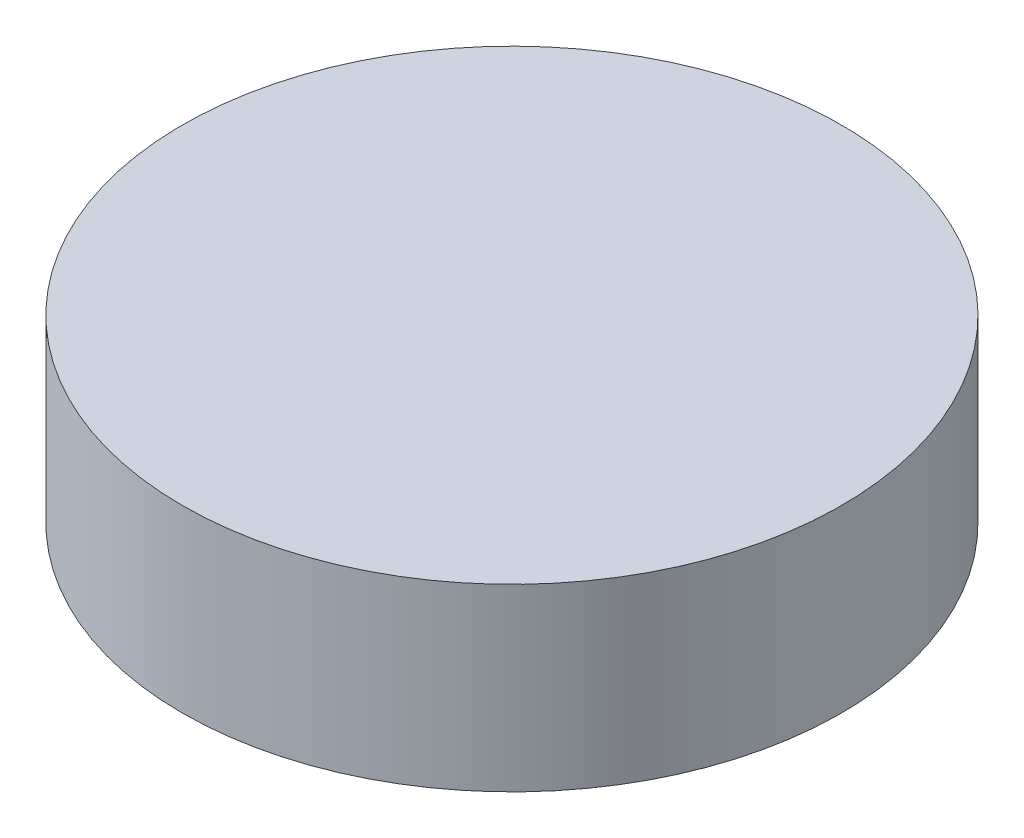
ISO-10303-21;
HEADER;
FILE_DESCRIPTION(('STEP AP214'),'2;1');
FILE_NAME('part.step','',(''),(''),'','','');
FILE_SCHEMA(('AUTOMOTIVE_DESIGN { 1 0 10303 214 1 1 1 1 }'));
ENDSEC;
DATA;
#1=APPLICATION_CONTEXT('core data for automotive mechanical design processes');
#2=APPLICATION_PROTOCOL_DEFINITION('international standard','automotive_design',2000,#1);
#3=PRODUCT_CONTEXT('',#1,'mechanical');
#4=PRODUCT('Part','Part','',(#3));
#5=PRODUCT_RELATED_PRODUCT_CATEGORY('part','',(#4));
#6=PRODUCT_DEFINITION_FORMATION('','',#4);
#7=PRODUCT_DEFINITION_CONTEXT('part definition',#1,'design');
#8=PRODUCT_DEFINITION('design','',#6,#7);
#9=PRODUCT_DEFINITION_SHAPE('','',#8);
#10=(LENGTH_UNIT() NAMED_UNIT(*) SI_UNIT(.MILLI.,.METRE.));
#11=(NAMED_UNIT(*) PLANE_ANGLE_UNIT() SI_UNIT($,.RADIAN.));
#12=(NAMED_UNIT(*) SI_UNIT($,.STERADIAN.) SOLID_ANGLE_UNIT());
#13=UNCERTAINTY_MEASURE_WITH_UNIT(LENGTH_MEASURE(1.E-05),#10,'distance_accuracy_value','');
#14=(GEOMETRIC_REPRESENTATION_CONTEXT(3) GLOBAL_UNCERTAINTY_ASSIGNED_CONTEXT((#13)) GLOBAL_UNIT_ASSIGNED_CONTEXT((#10,
#11,#12)) REPRESENTATION_CONTEXT('',''));
#15=CARTESIAN_POINT('',(0.,0.,0.));
#16=DIRECTION('',(0.,0.,1.));
#17=DIRECTION('',(1.,0.,0.));
#18=AXIS2_PLACEMENT_3D('',#15,#16,#17);
#19=CARTESIAN_POINT('',(0.,-19.05,0.));
#20=DIRECTION('',(0.,1.,0.));
#21=DIRECTION('',(0.,0.,1.));
#22=AXIS2_PLACEMENT_3D('',#19,#20,#21);
#23=CYLINDRICAL_SURFACE('',#22,34.925);
#24=CARTESIAN_POINT('',(0.,-19.05,0.));
#25=DIRECTION('',(0.,1.,0.));
#26=DIRECTION('',(0.,0.,1.));
#27=AXIS2_PLACEMENT_3D('',#24,#25,#26);
#28=CIRCLE('',#27,34.925);
#29=CARTESIAN_POINT('',(0.,-19.05,34.925));
#30=VERTEX_POINT('',#29);
#31=EDGE_CURVE('E10',#30,#30,#28,.T.);
#32=CARTESIAN_POINT('',(0.,0.,0.));
#33=DIRECTION('',(0.,1.,0.));
#34=DIRECTION('',(0.,0.,1.));
#35=AXIS2_PLACEMENT_3D('',#32,#33,#34);
#36=CIRCLE('',#35,34.925);
#37=CARTESIAN_POINT('',(0.,0.,34.925));
#38=VERTEX_POINT('',#37);
#39=EDGE_CURVE('E33',#38,#38,#36,.T.);
#40=CARTESIAN_POINT('',(0.,-19.05,34.925));
#41=CARTESIAN_POINT('',(0.,-18.8515625,34.925));
#42=CARTESIAN_POINT('',(0.,-18.653125,34.925));
#43=CARTESIAN_POINT('',(0.,-18.25625,34.925));
#44=CARTESIAN_POINT('',(0.,-18.0578125,34.925));
#45=CARTESIAN_POINT('',(0.,-17.6609375,34.925));
#46=CARTESIAN_POINT('',(0.,-17.4625,34.925));
#47=CARTESIAN_POINT('',(0.,-17.065625,34.925));
#48=CARTESIAN_POINT('',(0.,-16.8671875,34.925));
#49=CARTESIAN_POINT('',(0.,-16.4703125,34.925));
#50=CARTESIAN_POINT('',(0.,-16.271875,34.925));
#51=CARTESIAN_POINT('',(0.,-15.875,34.925));
#52=CARTESIAN_POINT('',(0.,-15.6765625,34.925));
#53=CARTESIAN_POINT('',(0.,-15.2796875,34.925));
#54=CARTESIAN_POINT('',(0.,-15.08125,34.925));
#55=CARTESIAN_POINT('',(0.,-14.684375,34.925));
#56=CARTESIAN_POINT('',(0.,-14.4859375,34.925));
#57=CARTESIAN_POINT('',(0.,-14.0890625,34.925));
#58=CARTESIAN_POINT('',(0.,-13.890625,34.925));
#59=CARTESIAN_POINT('',(0.,-13.49375,34.925));
#60=CARTESIAN_POINT('',(0.,-13.2953125,34.925));
#61=CARTESIAN_POINT('',(0.,-12.8984375,34.925));
#62=CARTESIAN_POINT('',(0.,-12.7,34.925));
#63=CARTESIAN_POINT('',(0.,-12.303125,34.925));
#64=CARTESIAN_POINT('',(0.,-12.1046875,34.925));
#65=CARTESIAN_POINT('',(0.,-11.7078125,34.925));
#66=CARTESIAN_POINT('',(0.,-11.509375,34.925));
#67=CARTESIAN_POINT('',(0.,-11.1125,34.925));
#68=CARTESIAN_POINT('',(0.,-10.9140625,34.925));
#69=CARTESIAN_POINT('',(0.,-10.5171875,34.925));
#70=CARTESIAN_POINT('',(0.,-10.31875,34.925));
#71=CARTESIAN_POINT('',(0.,-9.921875,34.925));
#72=CARTESIAN_POINT('',(0.,-9.7234375,34.925));
#73=CARTESIAN_POINT('',(0.,-9.3265625,34.925));
#74=CARTESIAN_POINT('',(0.,-9.128125,34.925));
#75=CARTESIAN_POINT('',(0.,-8.73125,34.925));
#76=CARTESIAN_POINT('',(0.,-8.5328125,34.925));
#77=CARTESIAN_POINT('',(0.,-8.1359375,34.925));
#78=CARTESIAN_POINT('',(0.,-7.9375,34.925));
#79=CARTESIAN_POINT('',(0.,-7.540625,34.925));
#80=CARTESIAN_POINT('',(0.,-7.3421875,34.925));
#81=CARTESIAN_POINT('',(0.,-6.9453125,34.925));
#82=CARTESIAN_POINT('',(0.,-6.746875,34.925));
#83=CARTESIAN_POINT('',(0.,-6.35,34.925));
#84=CARTESIAN_POINT('',(0.,-6.1515625,34.925));
#85=CARTESIAN_POINT('',(0.,-5.7546875,34.925));
#86=CARTESIAN_POINT('',(0.,-5.55625,34.925));
#87=CARTESIAN_POINT('',(0.,-5.159375,34.925));
#88=CARTESIAN_POINT('',(0.,-4.9609375,34.925));
#89=CARTESIAN_POINT('',(0.,-4.5640625,34.925));
#90=CARTESIAN_POINT('',(0.,-4.365625,34.925));
#91=CARTESIAN_POINT('',(0.,-3.96875,34.925));
#92=CARTESIAN_POINT('',(0.,-3.7703125,34.925));
#93=CARTESIAN_POINT('',(0.,-3.3734375,34.925));
#94=CARTESIAN_POINT('',(0.,-3.175,34.925));
#95=CARTESIAN_POINT('',(0.,-2.778125,34.925));
#96=CARTESIAN_POINT('',(0.,-2.5796875,34.925));
#97=CARTESIAN_POINT('',(0.,-2.1828125,34.925));
#98=CARTESIAN_POINT('',(0.,-1.984375,34.925));
#99=CARTESIAN_POINT('',(0.,-1.5875,34.925));
#100=CARTESIAN_POINT('',(0.,-1.3890625,34.925));
#101=CARTESIAN_POINT('',(0.,-0.992187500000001,34.925));
#102=CARTESIAN_POINT('',(0.,-0.793750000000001,34.925));
#103=CARTESIAN_POINT('',(0.,-0.396875,34.925));
#104=CARTESIAN_POINT('',(0.,-0.1984375,34.925));
#105=CARTESIAN_POINT('',(0.,0.,34.925));
#106=B_SPLINE_CURVE_WITH_KNOTS('',3,(#40,#41,#42,#43,#44,#45,#46,#47,#48,#49,#50,#51,#52,#53,
#54,#55,#56,#57,#58,#59,#60,#61,#62,#63,#64,#65,#66,#67,#68,#69,#70,#71,#72,#73,#74,#75,#76,#77,
#78,#79,#80,#81,#82,#83,#84,#85,#86,#87,#88,#89,#90,#91,#92,#93,#94,#95,#96,#97,#98,#99,#100,
#101,#102,#103,#104,#105),.UNSPECIFIED.,.F.,.F.,(4,2,2,2,2,2,2,2,2,2,2,2,2,2,2,2,2,2,2,2,2,2,2,
2,2,2,2,2,2,2,2,2,4),(0.,0.595312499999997,1.190625,1.7859375,2.38125,2.9765625,3.571875,
4.1671875,4.7625,5.3578125,5.953125,6.5484375,7.14375,7.7390625,8.334375,8.9296875,9.525,
10.1203125,10.715625,11.3109375,11.90625,12.5015625,13.096875,13.6921875,14.2875,14.8828125,
15.478125,16.0734375,16.66875,17.2640625,17.859375,18.4546875,19.05),.UNSPECIFIED.);
#107=EDGE_CURVE('BSEAM30',#30,#38,#106,.T.);
#108=ORIENTED_EDGE('',*,*,#31,.T.);
#109=ORIENTED_EDGE('',*,*,#39,.F.);
#110=ORIENTED_EDGE('',*,*,#107,.T.);
#111=ORIENTED_EDGE('',*,*,#107,.F.);
#112=EDGE_LOOP('',(#108,#110,#109,#111));
#113=FACE_BOUND('',#112,.T.);
#114=ADVANCED_FACE('F30',(#113),#23,.T.);
#115=CARTESIAN_POINT('',(0.,-19.05,0.));
#116=DIRECTION('',(0.,1.,0.));
#117=DIRECTION('',(0.,0.,1.));
#118=AXIS2_PLACEMENT_3D('',#115,#116,#117);
#119=PLANE('',#118);
#120=ORIENTED_EDGE('',*,*,#31,.F.);
#121=EDGE_LOOP('',(#120));
#122=FACE_BOUND('',#121,.T.);
#123=ADVANCED_FACE('F45',(#122),#119,.F.);
#124=CARTESIAN_POINT('',(0.,0.,0.));
#125=DIRECTION('',(0.,1.,0.));
#126=DIRECTION('',(0.,0.,1.));
#127=AXIS2_PLACEMENT_3D('',#124,#125,#126);
#128=PLANE('',#127);
#129=ORIENTED_EDGE('',*,*,#39,.T.);
#130=EDGE_LOOP('',(#129));
#131=FACE_BOUND('',#130,.T.);
#132=ADVANCED_FACE('F42',(#131),#128,.T.);
#133=CLOSED_SHELL('',(#114,#123,#132));
#134=MANIFOLD_SOLID_BREP('B2',#133);
#135=ADVANCED_BREP_SHAPE_REPRESENTATION('',(#18,#134),#14);
#136=SHAPE_DEFINITION_REPRESENTATION(#9,#135);
ENDSEC;
END-ISO-10303-21;
